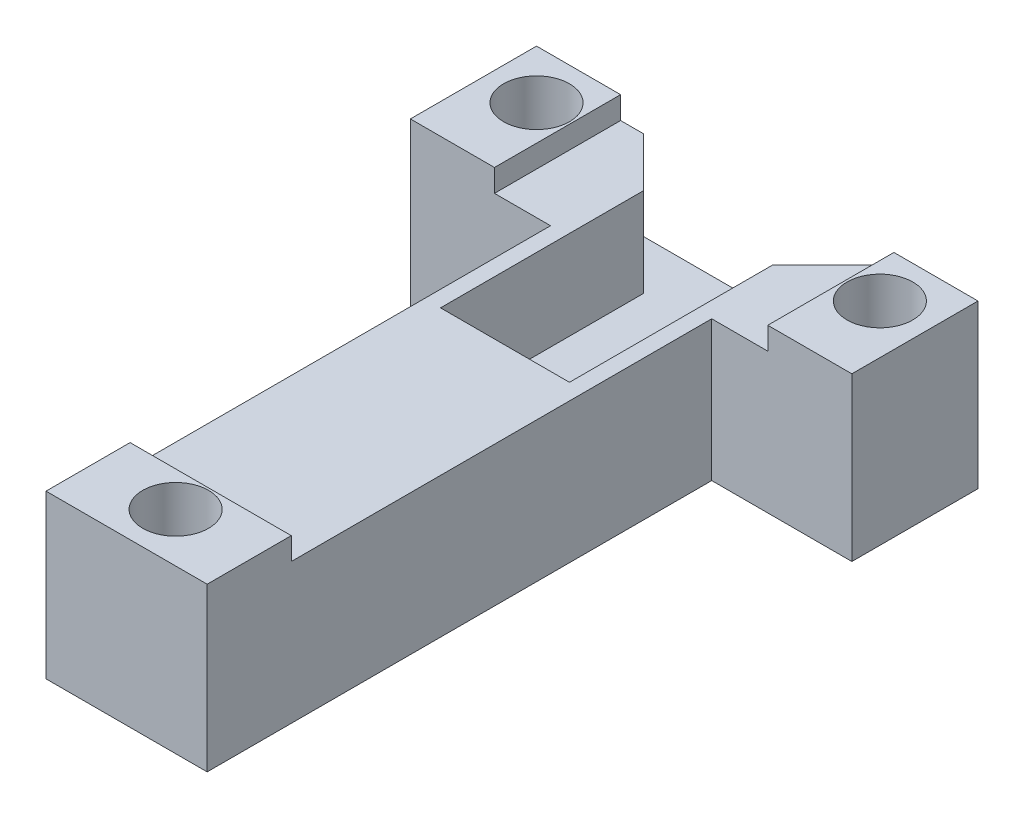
ISO-10303-21;
HEADER;
FILE_DESCRIPTION(('STEP AP214'),'2;1');
FILE_NAME('part.step','',(''),(''),'','','');
FILE_SCHEMA(('AUTOMOTIVE_DESIGN { 1 0 10303 214 1 1 1 1 }'));
ENDSEC;
DATA;
#1=APPLICATION_CONTEXT('core data for automotive mechanical design processes');
#2=APPLICATION_PROTOCOL_DEFINITION('international standard','automotive_design',2000,#1);
#3=PRODUCT_CONTEXT('',#1,'mechanical');
#4=PRODUCT('Part','Part','',(#3));
#5=PRODUCT_RELATED_PRODUCT_CATEGORY('part','',(#4));
#6=PRODUCT_DEFINITION_FORMATION('','',#4);
#7=PRODUCT_DEFINITION_CONTEXT('part definition',#1,'design');
#8=PRODUCT_DEFINITION('design','',#6,#7);
#9=PRODUCT_DEFINITION_SHAPE('','',#8);
#10=(LENGTH_UNIT() NAMED_UNIT(*) SI_UNIT(.MILLI.,.METRE.));
#11=(NAMED_UNIT(*) PLANE_ANGLE_UNIT() SI_UNIT($,.RADIAN.));
#12=(NAMED_UNIT(*) SI_UNIT($,.STERADIAN.) SOLID_ANGLE_UNIT());
#13=UNCERTAINTY_MEASURE_WITH_UNIT(LENGTH_MEASURE(1.E-05),#10,'distance_accuracy_value','');
#14=(GEOMETRIC_REPRESENTATION_CONTEXT(3) GLOBAL_UNCERTAINTY_ASSIGNED_CONTEXT((#13)) GLOBAL_UNIT_ASSIGNED_CONTEXT((#10,
#11,#12)) REPRESENTATION_CONTEXT('',''));
#15=CARTESIAN_POINT('',(0.,0.,0.));
#16=DIRECTION('',(0.,0.,1.));
#17=DIRECTION('',(1.,0.,0.));
#18=AXIS2_PLACEMENT_3D('',#15,#16,#17);
#19=CARTESIAN_POINT('',(0.,10.,-45.));
#20=DIRECTION('',(0.,0.,1.));
#21=DIRECTION('',(1.,0.,0.));
#22=AXIS2_PLACEMENT_3D('',#19,#20,#21);
#23=PLANE('',#22);
#24=DIRECTION('',(0.,1.,0.));
#25=VECTOR('',#24,1.);
#26=CARTESIAN_POINT('',(-2.35,3.65,-45.));
#27=LINE('',#26,#25);
#28=CARTESIAN_POINT('',(-2.35,3.65,-45.));
#29=VERTEX_POINT('',#28);
#30=CARTESIAN_POINT('',(-2.35,10.,-45.));
#31=VERTEX_POINT('',#30);
#32=EDGE_CURVE('E377',#29,#31,#27,.T.);
#33=ORIENTED_EDGE('',*,*,#32,.F.);
#34=DIRECTION('',(-1.,0.,0.));
#35=VECTOR('',#34,1.);
#36=CARTESIAN_POINT('',(0.,3.65,-45.));
#37=LINE('',#36,#35);
#38=CARTESIAN_POINT('',(13.85,3.65,-45.));
#39=VERTEX_POINT('',#38);
#40=EDGE_CURVE('E346',#39,#29,#37,.T.);
#41=ORIENTED_EDGE('',*,*,#40,.F.);
#42=DIRECTION('',(0.,1.,0.));
#43=VECTOR('',#42,1.);
#44=CARTESIAN_POINT('',(13.85,3.65,-45.));
#45=LINE('',#44,#43);
#46=CARTESIAN_POINT('',(13.85,10.,-45.));
#47=VERTEX_POINT('',#46);
#48=EDGE_CURVE('E380',#39,#47,#45,.T.);
#49=ORIENTED_EDGE('',*,*,#48,.T.);
#50=DIRECTION('',(-1.,0.,0.));
#51=VECTOR('',#50,1.);
#52=CARTESIAN_POINT('',(0.,10.,-45.));
#53=LINE('',#52,#51);
#54=CARTESIAN_POINT('',(15.5,10.,-45.));
#55=VERTEX_POINT('',#54);
#56=EDGE_CURVE('E405',#55,#47,#53,.T.);
#57=ORIENTED_EDGE('',*,*,#56,.F.);
#58=DIRECTION('',(0.,-1.,0.));
#59=VECTOR('',#58,1.);
#60=CARTESIAN_POINT('',(15.5,11.6,-45.));
#61=LINE('',#60,#59);
#62=CARTESIAN_POINT('',(15.5,11.6,-45.));
#63=VERTEX_POINT('',#62);
#64=EDGE_CURVE('E267',#63,#55,#61,.T.);
#65=ORIENTED_EDGE('',*,*,#64,.F.);
#66=DIRECTION('',(-1.,0.,0.));
#67=VECTOR('',#66,1.);
#68=CARTESIAN_POINT('',(0.,11.6,-45.));
#69=LINE('',#68,#67);
#70=CARTESIAN_POINT('',(21.5,11.6,-45.));
#71=VERTEX_POINT('',#70);
#72=EDGE_CURVE('E260',#71,#63,#69,.T.);
#73=ORIENTED_EDGE('',*,*,#72,.F.);
#74=DIRECTION('',(0.,-1.,0.));
#75=VECTOR('',#74,1.);
#76=CARTESIAN_POINT('',(21.5,10.,-45.));
#77=LINE('',#76,#75);
#78=CARTESIAN_POINT('',(21.5,0.,-45.));
#79=VERTEX_POINT('',#78);
#80=EDGE_CURVE('E440',#71,#79,#77,.T.);
#81=ORIENTED_EDGE('',*,*,#80,.T.);
#82=DIRECTION('',(-1.,0.,0.));
#83=VECTOR('',#82,1.);
#84=CARTESIAN_POINT('',(0.,0.,-45.));
#85=LINE('',#84,#83);
#86=CARTESIAN_POINT('',(-10.,0.,-45.));
#87=VERTEX_POINT('',#86);
#88=EDGE_CURVE('E404',#79,#87,#85,.T.);
#89=ORIENTED_EDGE('',*,*,#88,.T.);
#90=DIRECTION('',(0.,-1.,0.));
#91=VECTOR('',#90,1.);
#92=CARTESIAN_POINT('',(-10.,10.,-45.));
#93=LINE('',#92,#91);
#94=CARTESIAN_POINT('',(-10.,11.6,-45.));
#95=VERTEX_POINT('',#94);
#96=EDGE_CURVE('E408',#95,#87,#93,.T.);
#97=ORIENTED_EDGE('',*,*,#96,.F.);
#98=DIRECTION('',(-1.,0.,0.));
#99=VECTOR('',#98,1.);
#100=CARTESIAN_POINT('',(0.,11.6,-45.));
#101=LINE('',#100,#99);
#102=CARTESIAN_POINT('',(-4.,11.6,-45.));
#103=VERTEX_POINT('',#102);
#104=EDGE_CURVE('E287',#103,#95,#101,.T.);
#105=ORIENTED_EDGE('',*,*,#104,.F.);
#106=DIRECTION('',(0.,-1.,0.));
#107=VECTOR('',#106,1.);
#108=CARTESIAN_POINT('',(-4.,11.6,-45.));
#109=LINE('',#108,#107);
#110=CARTESIAN_POINT('',(-4.,10.,-45.));
#111=VERTEX_POINT('',#110);
#112=EDGE_CURVE('E295',#103,#111,#109,.T.);
#113=ORIENTED_EDGE('',*,*,#112,.T.);
#114=EDGE_CURVE('E403',#31,#111,#53,.T.);
#115=ORIENTED_EDGE('',*,*,#114,.F.);
#116=EDGE_LOOP('',(#33,#41,#49,#57,#65,#73,#81,#89,#97,#105,#113,#115));
#117=FACE_BOUND('',#116,.T.);
#118=ADVANCED_FACE('F69',(#117),#23,.F.);
#119=CARTESIAN_POINT('',(0.,10.,0.));
#120=DIRECTION('',(0.,1.,0.));
#121=DIRECTION('',(0.,0.,1.));
#122=AXIS2_PLACEMENT_3D('',#119,#120,#121);
#123=PLANE('',#122);
#124=DIRECTION('',(1.,0.,0.));
#125=VECTOR('',#124,1.);
#126=CARTESIAN_POINT('',(0.,10.,-6.));
#127=LINE('',#126,#125);
#128=CARTESIAN_POINT('',(0.,10.,-6.));
#129=VERTEX_POINT('',#128);
#130=CARTESIAN_POINT('',(11.5,10.,-6.));
#131=VERTEX_POINT('',#130);
#132=EDGE_CURVE('E87',#129,#131,#127,.T.);
#133=ORIENTED_EDGE('',*,*,#132,.T.);
#134=DIRECTION('',(0.,0.,-1.));
#135=VECTOR('',#134,1.);
#136=CARTESIAN_POINT('',(11.5,10.,0.));
#137=LINE('',#136,#135);
#138=CARTESIAN_POINT('',(11.5,10.,-36.));
#139=VERTEX_POINT('',#138);
#140=EDGE_CURVE('E446',#131,#139,#137,.T.);
#141=ORIENTED_EDGE('',*,*,#140,.T.);
#142=DIRECTION('',(-1.,0.,0.));
#143=VECTOR('',#142,1.);
#144=CARTESIAN_POINT('',(0.,10.,-36.));
#145=LINE('',#144,#143);
#146=CARTESIAN_POINT('',(15.5,10.,-36.));
#147=VERTEX_POINT('',#146);
#148=EDGE_CURVE('E425',#147,#139,#145,.T.);
#149=ORIENTED_EDGE('',*,*,#148,.F.);
#150=DIRECTION('',(0.,0.,-1.));
#151=VECTOR('',#150,1.);
#152=CARTESIAN_POINT('',(15.5,10.,0.));
#153=LINE('',#152,#151);
#154=EDGE_CURVE('E95',#147,#55,#153,.T.);
#155=ORIENTED_EDGE('',*,*,#154,.T.);
#156=ORIENTED_EDGE('',*,*,#56,.T.);
#157=DIRECTION('',(0.707106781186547,0.,-0.707106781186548));
#158=VECTOR('',#157,1.);
#159=CARTESIAN_POINT('',(-15.575,10.,-15.575));
#160=LINE('',#159,#158);
#161=CARTESIAN_POINT('',(10.35,10.,-41.5));
#162=VERTEX_POINT('',#161);
#163=EDGE_CURVE('E365',#162,#47,#160,.T.);
#164=ORIENTED_EDGE('',*,*,#163,.F.);
#165=DIRECTION('',(0.,0.,-1.));
#166=VECTOR('',#165,1.);
#167=CARTESIAN_POINT('',(10.35,10.,0.));
#168=LINE('',#167,#166);
#169=CARTESIAN_POINT('',(10.35,10.,-27.));
#170=VERTEX_POINT('',#169);
#171=EDGE_CURVE('E361',#170,#162,#168,.T.);
#172=ORIENTED_EDGE('',*,*,#171,.F.);
#173=DIRECTION('',(1.,0.,0.));
#174=VECTOR('',#173,1.);
#175=CARTESIAN_POINT('',(0.,10.,-27.));
#176=LINE('',#175,#174);
#177=CARTESIAN_POINT('',(1.15,10.,-27.));
#178=VERTEX_POINT('',#177);
#179=EDGE_CURVE('E357',#178,#170,#176,.T.);
#180=ORIENTED_EDGE('',*,*,#179,.F.);
#181=DIRECTION('',(0.,0.,-1.));
#182=VECTOR('',#181,1.);
#183=CARTESIAN_POINT('',(1.15,10.,0.));
#184=LINE('',#183,#182);
#185=CARTESIAN_POINT('',(1.15,10.,-41.5));
#186=VERTEX_POINT('',#185);
#187=EDGE_CURVE('E311',#178,#186,#184,.T.);
#188=ORIENTED_EDGE('',*,*,#187,.T.);
#189=DIRECTION('',(-0.707106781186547,0.,-0.707106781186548));
#190=VECTOR('',#189,1.);
#191=CARTESIAN_POINT('',(21.325,10.,-21.325));
#192=LINE('',#191,#190);
#193=EDGE_CURVE('E334',#186,#31,#192,.T.);
#194=ORIENTED_EDGE('',*,*,#193,.T.);
#195=ORIENTED_EDGE('',*,*,#114,.T.);
#196=DIRECTION('',(0.,0.,-1.));
#197=VECTOR('',#196,1.);
#198=CARTESIAN_POINT('',(-4.,10.,0.));
#199=LINE('',#198,#197);
#200=CARTESIAN_POINT('',(-4.,10.,-36.));
#201=VERTEX_POINT('',#200);
#202=EDGE_CURVE('E275',#201,#111,#199,.T.);
#203=ORIENTED_EDGE('',*,*,#202,.F.);
#204=DIRECTION('',(1.,0.,0.));
#205=VECTOR('',#204,1.);
#206=CARTESIAN_POINT('',(0.,10.,-36.));
#207=LINE('',#206,#205);
#208=CARTESIAN_POINT('',(0.,10.,-36.));
#209=VERTEX_POINT('',#208);
#210=EDGE_CURVE('E399',#201,#209,#207,.T.);
#211=ORIENTED_EDGE('',*,*,#210,.T.);
#212=DIRECTION('',(0.,0.,-1.));
#213=VECTOR('',#212,1.);
#214=CARTESIAN_POINT('',(0.,10.,0.));
#215=LINE('',#214,#213);
#216=EDGE_CURVE('E449',#129,#209,#215,.T.);
#217=ORIENTED_EDGE('',*,*,#216,.F.);
#218=EDGE_LOOP('',(#133,#141,#149,#155,#156,#164,#172,#180,#188,#194,#195,#203,#211,#217));
#219=FACE_BOUND('',#218,.T.);
#220=ADVANCED_FACE('F494',(#219),#123,.T.);
#221=CARTESIAN_POINT('',(-9.99999999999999,10.,0.));
#222=DIRECTION('',(1.,0.,0.));
#223=DIRECTION('',(0.,0.,-1.));
#224=AXIS2_PLACEMENT_3D('',#221,#222,#223);
#225=PLANE('',#224);
#226=DIRECTION('',(0.,0.,1.));
#227=VECTOR('',#226,1.);
#228=CARTESIAN_POINT('',(-9.99999999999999,0.,0.));
#229=LINE('',#228,#227);
#230=CARTESIAN_POINT('',(-10.,0.,-36.));
#231=VERTEX_POINT('',#230);
#232=EDGE_CURVE('E409',#87,#231,#229,.T.);
#233=ORIENTED_EDGE('',*,*,#232,.T.);
#234=DIRECTION('',(0.,-1.,0.));
#235=VECTOR('',#234,1.);
#236=CARTESIAN_POINT('',(-10.,10.,-36.));
#237=LINE('',#236,#235);
#238=CARTESIAN_POINT('',(-10.,11.6,-36.));
#239=VERTEX_POINT('',#238);
#240=EDGE_CURVE('E12',#239,#231,#237,.T.);
#241=ORIENTED_EDGE('',*,*,#240,.F.);
#242=DIRECTION('',(0.,0.,1.));
#243=VECTOR('',#242,1.);
#244=CARTESIAN_POINT('',(-9.99999999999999,11.6,0.));
#245=LINE('',#244,#243);
#246=EDGE_CURVE('E291',#95,#239,#245,.T.);
#247=ORIENTED_EDGE('',*,*,#246,.F.);
#248=ORIENTED_EDGE('',*,*,#96,.T.);
#249=EDGE_LOOP('',(#233,#241,#247,#248));
#250=FACE_BOUND('',#249,.T.);
#251=ADVANCED_FACE('F480',(#250),#225,.F.);
#252=CARTESIAN_POINT('',(0.,10.,-36.));
#253=DIRECTION('',(0.,0.,-1.));
#254=DIRECTION('',(-1.,0.,0.));
#255=AXIS2_PLACEMENT_3D('',#252,#253,#254);
#256=PLANE('',#255);
#257=DIRECTION('',(1.,0.,0.));
#258=VECTOR('',#257,1.);
#259=CARTESIAN_POINT('',(0.,0.,-36.));
#260=LINE('',#259,#258);
#261=CARTESIAN_POINT('',(0.,0.,-36.));
#262=VERTEX_POINT('',#261);
#263=EDGE_CURVE('E413',#231,#262,#260,.T.);
#264=ORIENTED_EDGE('',*,*,#263,.T.);
#265=DIRECTION('',(0.,-1.,0.));
#266=VECTOR('',#265,1.);
#267=CARTESIAN_POINT('',(0.,10.,-36.));
#268=LINE('',#267,#266);
#269=EDGE_CURVE('E79',#209,#262,#268,.T.);
#270=ORIENTED_EDGE('',*,*,#269,.F.);
#271=ORIENTED_EDGE('',*,*,#210,.F.);
#272=DIRECTION('',(0.,-1.,0.));
#273=VECTOR('',#272,1.);
#274=CARTESIAN_POINT('',(-4.,11.6,-36.));
#275=LINE('',#274,#273);
#276=CARTESIAN_POINT('',(-4.,11.6,-36.));
#277=VERTEX_POINT('',#276);
#278=EDGE_CURVE('E302',#277,#201,#275,.T.);
#279=ORIENTED_EDGE('',*,*,#278,.F.);
#280=DIRECTION('',(1.,0.,0.));
#281=VECTOR('',#280,1.);
#282=CARTESIAN_POINT('',(0.,11.6,-36.));
#283=LINE('',#282,#281);
#284=EDGE_CURVE('E280',#239,#277,#283,.T.);
#285=ORIENTED_EDGE('',*,*,#284,.F.);
#286=ORIENTED_EDGE('',*,*,#240,.T.);
#287=EDGE_LOOP('',(#264,#270,#271,#279,#285,#286));
#288=FACE_BOUND('',#287,.T.);
#289=ADVANCED_FACE('F476',(#288),#256,.F.);
#290=CARTESIAN_POINT('',(0.,0.,0.));
#291=DIRECTION('',(0.,1.,0.));
#292=DIRECTION('',(0.,0.,1.));
#293=AXIS2_PLACEMENT_3D('',#290,#291,#292);
#294=PLANE('',#293);
#295=CARTESIAN_POINT('',(5.74999999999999,0.,-10.));
#296=DIRECTION('',(0.,-1.,0.));
#297=DIRECTION('',(0.,0.,-1.));
#298=AXIS2_PLACEMENT_3D('',#295,#296,#297);
#299=CIRCLE('',#298,2.3495);
#300=CARTESIAN_POINT('',(5.74999999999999,0.,-12.3495));
#301=VERTEX_POINT('',#300);
#302=EDGE_CURVE('E312',#301,#301,#299,.T.);
#303=ORIENTED_EDGE('',*,*,#302,.F.);
#304=EDGE_LOOP('',(#303));
#305=FACE_BOUND('',#304,.T.);
#306=CARTESIAN_POINT('',(5.75,0.,-22.));
#307=DIRECTION('',(0.,-1.,0.));
#308=DIRECTION('',(0.,0.,-1.));
#309=AXIS2_PLACEMENT_3D('',#306,#307,#308);
#310=CIRCLE('',#309,2.3495);
#311=CARTESIAN_POINT('',(5.75,0.,-24.3495));
#312=VERTEX_POINT('',#311);
#313=EDGE_CURVE('E316',#312,#312,#310,.T.);
#314=ORIENTED_EDGE('',*,*,#313,.F.);
#315=EDGE_LOOP('',(#314));
#316=FACE_BOUND('',#315,.T.);
#317=ORIENTED_EDGE('',*,*,#232,.F.);
#318=ORIENTED_EDGE('',*,*,#88,.F.);
#319=DIRECTION('',(0.,0.,1.));
#320=VECTOR('',#319,1.);
#321=CARTESIAN_POINT('',(21.5,0.,0.));
#322=LINE('',#321,#320);
#323=CARTESIAN_POINT('',(21.5,0.,-36.));
#324=VERTEX_POINT('',#323);
#325=EDGE_CURVE('E430',#79,#324,#322,.T.);
#326=ORIENTED_EDGE('',*,*,#325,.T.);
#327=DIRECTION('',(-1.,0.,0.));
#328=VECTOR('',#327,1.);
#329=CARTESIAN_POINT('',(0.,0.,-36.));
#330=LINE('',#329,#328);
#331=CARTESIAN_POINT('',(11.5,0.,-36.));
#332=VERTEX_POINT('',#331);
#333=EDGE_CURVE('E431',#324,#332,#330,.T.);
#334=ORIENTED_EDGE('',*,*,#333,.T.);
#335=DIRECTION('',(0.,0.,-1.));
#336=VECTOR('',#335,1.);
#337=CARTESIAN_POINT('',(11.5,0.,0.));
#338=LINE('',#337,#336);
#339=CARTESIAN_POINT('',(11.5,0.,0.));
#340=VERTEX_POINT('',#339);
#341=EDGE_CURVE('E456',#340,#332,#338,.T.);
#342=ORIENTED_EDGE('',*,*,#341,.F.);
#343=DIRECTION('',(1.,0.,0.));
#344=VECTOR('',#343,1.);
#345=CARTESIAN_POINT('',(0.,0.,0.));
#346=LINE('',#345,#344);
#347=CARTESIAN_POINT('',(0.,0.,0.));
#348=VERTEX_POINT('',#347);
#349=EDGE_CURVE('E327',#348,#340,#346,.T.);
#350=ORIENTED_EDGE('',*,*,#349,.F.);
#351=DIRECTION('',(0.,0.,-1.));
#352=VECTOR('',#351,1.);
#353=CARTESIAN_POINT('',(0.,0.,0.));
#354=LINE('',#353,#352);
#355=EDGE_CURVE('E450',#348,#262,#354,.T.);
#356=ORIENTED_EDGE('',*,*,#355,.T.);
#357=ORIENTED_EDGE('',*,*,#263,.F.);
#358=EDGE_LOOP('',(#317,#318,#326,#334,#342,#350,#356,#357));
#359=FACE_BOUND('',#358,.T.);
#360=ADVANCED_FACE('F472',(#305,#316,#359),#294,.F.);
#361=CARTESIAN_POINT('',(21.5,10.,0.));
#362=DIRECTION('',(1.,0.,0.));
#363=DIRECTION('',(0.,0.,-1.));
#364=AXIS2_PLACEMENT_3D('',#361,#362,#363);
#365=PLANE('',#364);
#366=ORIENTED_EDGE('',*,*,#325,.F.);
#367=ORIENTED_EDGE('',*,*,#80,.F.);
#368=DIRECTION('',(0.,0.,-1.));
#369=VECTOR('',#368,1.);
#370=CARTESIAN_POINT('',(21.5,11.6,0.));
#371=LINE('',#370,#369);
#372=CARTESIAN_POINT('',(21.5,11.6,-36.));
#373=VERTEX_POINT('',#372);
#374=EDGE_CURVE('E256',#373,#71,#371,.T.);
#375=ORIENTED_EDGE('',*,*,#374,.F.);
#376=DIRECTION('',(0.,-1.,0.));
#377=VECTOR('',#376,1.);
#378=CARTESIAN_POINT('',(21.5,10.,-36.));
#379=LINE('',#378,#377);
#380=EDGE_CURVE('E414',#373,#324,#379,.T.);
#381=ORIENTED_EDGE('',*,*,#380,.T.);
#382=EDGE_LOOP('',(#366,#367,#375,#381));
#383=FACE_BOUND('',#382,.T.);
#384=ADVANCED_FACE('F532',(#383),#365,.T.);
#385=CARTESIAN_POINT('',(0.,10.,-36.));
#386=DIRECTION('',(0.,0.,1.));
#387=DIRECTION('',(1.,0.,0.));
#388=AXIS2_PLACEMENT_3D('',#385,#386,#387);
#389=PLANE('',#388);
#390=ORIENTED_EDGE('',*,*,#333,.F.);
#391=ORIENTED_EDGE('',*,*,#380,.F.);
#392=DIRECTION('',(1.,0.,0.));
#393=VECTOR('',#392,1.);
#394=CARTESIAN_POINT('',(0.,11.6,-36.));
#395=LINE('',#394,#393);
#396=CARTESIAN_POINT('',(15.5,11.6,-36.));
#397=VERTEX_POINT('',#396);
#398=EDGE_CURVE('E252',#397,#373,#395,.T.);
#399=ORIENTED_EDGE('',*,*,#398,.F.);
#400=DIRECTION('',(0.,-1.,0.));
#401=VECTOR('',#400,1.);
#402=CARTESIAN_POINT('',(15.5,11.6,-36.));
#403=LINE('',#402,#401);
#404=EDGE_CURVE('E272',#397,#147,#403,.T.);
#405=ORIENTED_EDGE('',*,*,#404,.T.);
#406=ORIENTED_EDGE('',*,*,#148,.T.);
#407=DIRECTION('',(0.,-1.,0.));
#408=VECTOR('',#407,1.);
#409=CARTESIAN_POINT('',(11.5,10.,-36.));
#410=LINE('',#409,#408);
#411=EDGE_CURVE('E429',#139,#332,#410,.T.);
#412=ORIENTED_EDGE('',*,*,#411,.T.);
#413=EDGE_LOOP('',(#390,#391,#399,#405,#406,#412));
#414=FACE_BOUND('',#413,.T.);
#415=ADVANCED_FACE('F521',(#414),#389,.T.);
#416=CARTESIAN_POINT('',(11.5,10.,0.));
#417=DIRECTION('',(-1.,0.,0.));
#418=DIRECTION('',(0.,0.,1.));
#419=AXIS2_PLACEMENT_3D('',#416,#417,#418);
#420=PLANE('',#419);
#421=ORIENTED_EDGE('',*,*,#411,.F.);
#422=ORIENTED_EDGE('',*,*,#140,.F.);
#423=DIRECTION('',(0.,-1.,0.));
#424=VECTOR('',#423,1.);
#425=CARTESIAN_POINT('',(11.5,11.6,-6.));
#426=LINE('',#425,#424);
#427=CARTESIAN_POINT('',(11.5,11.6,-6.));
#428=VERTEX_POINT('',#427);
#429=EDGE_CURVE('E215',#428,#131,#426,.T.);
#430=ORIENTED_EDGE('',*,*,#429,.F.);
#431=DIRECTION('',(0.,0.,-1.));
#432=VECTOR('',#431,1.);
#433=CARTESIAN_POINT('',(11.5,11.6,0.));
#434=LINE('',#433,#432);
#435=CARTESIAN_POINT('',(11.5,11.6,0.));
#436=VERTEX_POINT('',#435);
#437=EDGE_CURVE('E231',#436,#428,#434,.T.);
#438=ORIENTED_EDGE('',*,*,#437,.F.);
#439=DIRECTION('',(0.,-1.,0.));
#440=VECTOR('',#439,1.);
#441=CARTESIAN_POINT('',(11.5,10.,0.));
#442=LINE('',#441,#440);
#443=EDGE_CURVE('E73',#436,#340,#442,.T.);
#444=ORIENTED_EDGE('',*,*,#443,.T.);
#445=ORIENTED_EDGE('',*,*,#341,.T.);
#446=EDGE_LOOP('',(#421,#422,#430,#438,#444,#445));
#447=FACE_BOUND('',#446,.T.);
#448=ADVANCED_FACE('F469',(#447),#420,.F.);
#449=CARTESIAN_POINT('',(0.,10.,0.));
#450=DIRECTION('',(0.,0.,-1.));
#451=DIRECTION('',(-1.,0.,0.));
#452=AXIS2_PLACEMENT_3D('',#449,#450,#451);
#453=PLANE('',#452);
#454=ORIENTED_EDGE('',*,*,#349,.T.);
#455=ORIENTED_EDGE('',*,*,#443,.F.);
#456=DIRECTION('',(1.,0.,0.));
#457=VECTOR('',#456,1.);
#458=CARTESIAN_POINT('',(0.,11.6,0.));
#459=LINE('',#458,#457);
#460=CARTESIAN_POINT('',(0.,11.6,0.));
#461=VERTEX_POINT('',#460);
#462=EDGE_CURVE('E226',#461,#436,#459,.T.);
#463=ORIENTED_EDGE('',*,*,#462,.F.);
#464=DIRECTION('',(0.,-1.,0.));
#465=VECTOR('',#464,1.);
#466=CARTESIAN_POINT('',(0.,10.,0.));
#467=LINE('',#466,#465);
#468=EDGE_CURVE('E221',#461,#348,#467,.T.);
#469=ORIENTED_EDGE('',*,*,#468,.T.);
#470=EDGE_LOOP('',(#454,#455,#463,#469));
#471=FACE_BOUND('',#470,.T.);
#472=ADVANCED_FACE('F71',(#471),#453,.F.);
#473=CARTESIAN_POINT('',(0.,10.,0.));
#474=DIRECTION('',(-1.,0.,0.));
#475=DIRECTION('',(0.,0.,1.));
#476=AXIS2_PLACEMENT_3D('',#473,#474,#475);
#477=PLANE('',#476);
#478=ORIENTED_EDGE('',*,*,#468,.F.);
#479=DIRECTION('',(0.,0.,1.));
#480=VECTOR('',#479,1.);
#481=CARTESIAN_POINT('',(0.,11.6,0.));
#482=LINE('',#481,#480);
#483=CARTESIAN_POINT('',(0.,11.6,-6.));
#484=VERTEX_POINT('',#483);
#485=EDGE_CURVE('E218',#484,#461,#482,.T.);
#486=ORIENTED_EDGE('',*,*,#485,.F.);
#487=DIRECTION('',(0.,-1.,0.));
#488=VECTOR('',#487,1.);
#489=CARTESIAN_POINT('',(0.,11.6,-6.));
#490=LINE('',#489,#488);
#491=EDGE_CURVE('E207',#484,#129,#490,.T.);
#492=ORIENTED_EDGE('',*,*,#491,.T.);
#493=ORIENTED_EDGE('',*,*,#216,.T.);
#494=ORIENTED_EDGE('',*,*,#269,.T.);
#495=ORIENTED_EDGE('',*,*,#355,.F.);
#496=EDGE_LOOP('',(#478,#486,#492,#493,#494,#495));
#497=FACE_BOUND('',#496,.T.);
#498=ADVANCED_FACE('F219',(#497),#477,.T.);
#499=CARTESIAN_POINT('',(1.15,3.65,0.));
#500=DIRECTION('',(1.,0.,0.));
#501=DIRECTION('',(0.,0.,-1.));
#502=AXIS2_PLACEMENT_3D('',#499,#500,#501);
#503=PLANE('',#502);
#504=ORIENTED_EDGE('',*,*,#187,.F.);
#505=DIRECTION('',(0.,1.,0.));
#506=VECTOR('',#505,1.);
#507=CARTESIAN_POINT('',(1.15,3.65,-27.));
#508=LINE('',#507,#506);
#509=CARTESIAN_POINT('',(1.15,3.65,-27.));
#510=VERTEX_POINT('',#509);
#511=EDGE_CURVE('E353',#510,#178,#508,.T.);
#512=ORIENTED_EDGE('',*,*,#511,.F.);
#513=DIRECTION('',(0.,0.,-1.));
#514=VECTOR('',#513,1.);
#515=CARTESIAN_POINT('',(1.15,3.65,0.));
#516=LINE('',#515,#514);
#517=CARTESIAN_POINT('',(1.15,3.65,-41.5));
#518=VERTEX_POINT('',#517);
#519=EDGE_CURVE('E329',#510,#518,#516,.T.);
#520=ORIENTED_EDGE('',*,*,#519,.T.);
#521=DIRECTION('',(0.,1.,0.));
#522=VECTOR('',#521,1.);
#523=CARTESIAN_POINT('',(1.15,3.65,-41.5));
#524=LINE('',#523,#522);
#525=EDGE_CURVE('E372',#518,#186,#524,.T.);
#526=ORIENTED_EDGE('',*,*,#525,.T.);
#527=EDGE_LOOP('',(#504,#512,#520,#526));
#528=FACE_BOUND('',#527,.T.);
#529=ADVANCED_FACE('F500',(#528),#503,.T.);
#530=CARTESIAN_POINT('',(21.325,3.65,-21.325));
#531=DIRECTION('',(0.707106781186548,0.,-0.707106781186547));
#532=DIRECTION('',(-0.707106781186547,0.,-0.707106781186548));
#533=AXIS2_PLACEMENT_3D('',#530,#531,#532);
#534=PLANE('',#533);
#535=ORIENTED_EDGE('',*,*,#193,.F.);
#536=ORIENTED_EDGE('',*,*,#525,.F.);
#537=DIRECTION('',(-0.707106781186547,0.,-0.707106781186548));
#538=VECTOR('',#537,1.);
#539=CARTESIAN_POINT('',(21.325,3.65,-21.325));
#540=LINE('',#539,#538);
#541=EDGE_CURVE('E350',#518,#29,#540,.T.);
#542=ORIENTED_EDGE('',*,*,#541,.T.);
#543=ORIENTED_EDGE('',*,*,#32,.T.);
#544=EDGE_LOOP('',(#535,#536,#542,#543));
#545=FACE_BOUND('',#544,.T.);
#546=ADVANCED_FACE('F498',(#545),#534,.T.);
#547=CARTESIAN_POINT('',(-15.575,3.65,-15.575));
#548=DIRECTION('',(0.707106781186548,0.,0.707106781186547));
#549=DIRECTION('',(0.707106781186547,0.,-0.707106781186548));
#550=AXIS2_PLACEMENT_3D('',#547,#548,#549);
#551=PLANE('',#550);
#552=ORIENTED_EDGE('',*,*,#163,.T.);
#553=ORIENTED_EDGE('',*,*,#48,.F.);
#554=DIRECTION('',(0.707106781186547,0.,-0.707106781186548));
#555=VECTOR('',#554,1.);
#556=CARTESIAN_POINT('',(-15.575,3.65,-15.575));
#557=LINE('',#556,#555);
#558=CARTESIAN_POINT('',(10.35,3.65,-41.5));
#559=VERTEX_POINT('',#558);
#560=EDGE_CURVE('E342',#559,#39,#557,.T.);
#561=ORIENTED_EDGE('',*,*,#560,.F.);
#562=DIRECTION('',(0.,1.,0.));
#563=VECTOR('',#562,1.);
#564=CARTESIAN_POINT('',(10.35,3.65,-41.5));
#565=LINE('',#564,#563);
#566=EDGE_CURVE('E384',#559,#162,#565,.T.);
#567=ORIENTED_EDGE('',*,*,#566,.T.);
#568=EDGE_LOOP('',(#552,#553,#561,#567));
#569=FACE_BOUND('',#568,.T.);
#570=ADVANCED_FACE('F515',(#569),#551,.F.);
#571=CARTESIAN_POINT('',(10.35,3.65,0.));
#572=DIRECTION('',(1.,0.,0.));
#573=DIRECTION('',(0.,0.,-1.));
#574=AXIS2_PLACEMENT_3D('',#571,#572,#573);
#575=PLANE('',#574);
#576=ORIENTED_EDGE('',*,*,#171,.T.);
#577=ORIENTED_EDGE('',*,*,#566,.F.);
#578=DIRECTION('',(0.,0.,-1.));
#579=VECTOR('',#578,1.);
#580=CARTESIAN_POINT('',(10.35,3.65,0.));
#581=LINE('',#580,#579);
#582=CARTESIAN_POINT('',(10.35,3.65,-27.));
#583=VERTEX_POINT('',#582);
#584=EDGE_CURVE('E338',#583,#559,#581,.T.);
#585=ORIENTED_EDGE('',*,*,#584,.F.);
#586=DIRECTION('',(0.,1.,0.));
#587=VECTOR('',#586,1.);
#588=CARTESIAN_POINT('',(10.35,3.65,-27.));
#589=LINE('',#588,#587);
#590=EDGE_CURVE('E387',#583,#170,#589,.T.);
#591=ORIENTED_EDGE('',*,*,#590,.T.);
#592=EDGE_LOOP('',(#576,#577,#585,#591));
#593=FACE_BOUND('',#592,.T.);
#594=ADVANCED_FACE('F510',(#593),#575,.F.);
#595=CARTESIAN_POINT('',(0.,3.65,-27.));
#596=DIRECTION('',(0.,0.,1.));
#597=DIRECTION('',(1.,0.,0.));
#598=AXIS2_PLACEMENT_3D('',#595,#596,#597);
#599=PLANE('',#598);
#600=ORIENTED_EDGE('',*,*,#179,.T.);
#601=ORIENTED_EDGE('',*,*,#590,.F.);
#602=DIRECTION('',(1.,0.,0.));
#603=VECTOR('',#602,1.);
#604=CARTESIAN_POINT('',(0.,3.65,-27.));
#605=LINE('',#604,#603);
#606=EDGE_CURVE('E333',#510,#583,#605,.T.);
#607=ORIENTED_EDGE('',*,*,#606,.F.);
#608=ORIENTED_EDGE('',*,*,#511,.T.);
#609=EDGE_LOOP('',(#600,#601,#607,#608));
#610=FACE_BOUND('',#609,.T.);
#611=ADVANCED_FACE('F506',(#610),#599,.F.);
#612=CARTESIAN_POINT('',(0.,3.65,0.));
#613=DIRECTION('',(0.,1.,0.));
#614=DIRECTION('',(0.,0.,1.));
#615=AXIS2_PLACEMENT_3D('',#612,#613,#614);
#616=PLANE('',#615);
#617=ORIENTED_EDGE('',*,*,#519,.F.);
#618=ORIENTED_EDGE('',*,*,#606,.T.);
#619=ORIENTED_EDGE('',*,*,#584,.T.);
#620=ORIENTED_EDGE('',*,*,#560,.T.);
#621=ORIENTED_EDGE('',*,*,#40,.T.);
#622=ORIENTED_EDGE('',*,*,#541,.F.);
#623=EDGE_LOOP('',(#617,#618,#619,#620,#621,#622));
#624=FACE_BOUND('',#623,.T.);
#625=ADVANCED_FACE('F504',(#624),#616,.T.);
#626=CARTESIAN_POINT('',(5.75,6.35,-22.));
#627=DIRECTION('',(0.,-1.,0.));
#628=DIRECTION('',(0.,0.,-1.));
#629=AXIS2_PLACEMENT_3D('',#626,#627,#628);
#630=CYLINDRICAL_SURFACE('',#629,2.3495);
#631=CARTESIAN_POINT('',(5.75,6.35,-22.));
#632=DIRECTION('',(0.,-1.,0.));
#633=DIRECTION('',(0.,0.,-1.));
#634=AXIS2_PLACEMENT_3D('',#631,#632,#633);
#635=CIRCLE('',#634,2.3495);
#636=CARTESIAN_POINT('',(5.75,6.35,-24.3495));
#637=VERTEX_POINT('',#636);
#638=EDGE_CURVE('E306',#637,#637,#635,.T.);
#639=ORIENTED_EDGE('',*,*,#638,.F.);
#640=EDGE_LOOP('',(#639));
#641=FACE_BOUND('',#640,.T.);
#642=ORIENTED_EDGE('',*,*,#313,.T.);
#643=EDGE_LOOP('',(#642));
#644=FACE_BOUND('',#643,.T.);
#645=ADVANCED_FACE('F701',(#641,#644),#630,.F.);
#646=CARTESIAN_POINT('',(5.75,6.35,-22.));
#647=DIRECTION('',(0.,-1.,0.));
#648=DIRECTION('',(0.,0.,-1.));
#649=AXIS2_PLACEMENT_3D('',#646,#647,#648);
#650=PLANE('',#649);
#651=ORIENTED_EDGE('',*,*,#638,.T.);
#652=EDGE_LOOP('',(#651));
#653=FACE_BOUND('',#652,.T.);
#654=ADVANCED_FACE('F705',(#653),#650,.T.);
#655=CARTESIAN_POINT('',(5.74999999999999,6.35,-10.));
#656=DIRECTION('',(0.,-1.,0.));
#657=DIRECTION('',(0.,0.,-1.));
#658=AXIS2_PLACEMENT_3D('',#655,#656,#657);
#659=CYLINDRICAL_SURFACE('',#658,2.3495);
#660=CARTESIAN_POINT('',(5.74999999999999,6.35,-10.));
#661=DIRECTION('',(0.,-1.,0.));
#662=DIRECTION('',(0.,0.,-1.));
#663=AXIS2_PLACEMENT_3D('',#660,#661,#662);
#664=CIRCLE('',#663,2.3495);
#665=CARTESIAN_POINT('',(5.74999999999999,6.35,-12.3495));
#666=VERTEX_POINT('',#665);
#667=EDGE_CURVE('E307',#666,#666,#664,.T.);
#668=ORIENTED_EDGE('',*,*,#667,.F.);
#669=EDGE_LOOP('',(#668));
#670=FACE_BOUND('',#669,.T.);
#671=ORIENTED_EDGE('',*,*,#302,.T.);
#672=EDGE_LOOP('',(#671));
#673=FACE_BOUND('',#672,.T.);
#674=ADVANCED_FACE('F716',(#670,#673),#659,.F.);
#675=CARTESIAN_POINT('',(5.74999999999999,6.35,-10.));
#676=DIRECTION('',(0.,-1.,0.));
#677=DIRECTION('',(0.,0.,-1.));
#678=AXIS2_PLACEMENT_3D('',#675,#676,#677);
#679=PLANE('',#678);
#680=ORIENTED_EDGE('',*,*,#667,.T.);
#681=EDGE_LOOP('',(#680));
#682=FACE_BOUND('',#681,.T.);
#683=ADVANCED_FACE('F585',(#682),#679,.T.);
#684=CARTESIAN_POINT('',(-4.,11.6,0.));
#685=DIRECTION('',(-1.,0.,0.));
#686=DIRECTION('',(0.,0.,1.));
#687=AXIS2_PLACEMENT_3D('',#684,#685,#686);
#688=PLANE('',#687);
#689=ORIENTED_EDGE('',*,*,#202,.T.);
#690=ORIENTED_EDGE('',*,*,#112,.F.);
#691=DIRECTION('',(0.,0.,-1.));
#692=VECTOR('',#691,1.);
#693=CARTESIAN_POINT('',(-4.,11.6,0.));
#694=LINE('',#693,#692);
#695=EDGE_CURVE('E284',#277,#103,#694,.T.);
#696=ORIENTED_EDGE('',*,*,#695,.F.);
#697=ORIENTED_EDGE('',*,*,#278,.T.);
#698=EDGE_LOOP('',(#689,#690,#696,#697));
#699=FACE_BOUND('',#698,.T.);
#700=ADVANCED_FACE('F489',(#699),#688,.F.);
#701=CARTESIAN_POINT('',(0.,11.6,0.));
#702=DIRECTION('',(0.,1.,0.));
#703=DIRECTION('',(0.,0.,1.));
#704=AXIS2_PLACEMENT_3D('',#701,#702,#703);
#705=PLANE('',#704);
#706=CARTESIAN_POINT('',(-6.5,11.6,-41.5));
#707=DIRECTION('',(0.,1.,0.));
#708=DIRECTION('',(0.,0.,1.));
#709=AXIS2_PLACEMENT_3D('',#706,#707,#708);
#710=CIRCLE('',#709,2.3495);
#711=CARTESIAN_POINT('',(-6.5,11.6,-39.1505));
#712=VERTEX_POINT('',#711);
#713=EDGE_CURVE('E276',#712,#712,#710,.F.);
#714=ORIENTED_EDGE('',*,*,#713,.T.);
#715=EDGE_LOOP('',(#714));
#716=FACE_BOUND('',#715,.T.);
#717=ORIENTED_EDGE('',*,*,#284,.T.);
#718=ORIENTED_EDGE('',*,*,#695,.T.);
#719=ORIENTED_EDGE('',*,*,#104,.T.);
#720=ORIENTED_EDGE('',*,*,#246,.T.);
#721=EDGE_LOOP('',(#717,#718,#719,#720));
#722=FACE_BOUND('',#721,.T.);
#723=ADVANCED_FACE('F486',(#716,#722),#705,.T.);
#724=CARTESIAN_POINT('',(0.,3.65,0.));
#725=DIRECTION('',(0.,1.,0.));
#726=DIRECTION('',(0.,0.,1.));
#727=AXIS2_PLACEMENT_3D('',#724,#725,#726);
#728=PLANE('',#727);
#729=CARTESIAN_POINT('',(-6.5,3.65,-41.5));
#730=DIRECTION('',(0.,1.,0.));
#731=DIRECTION('',(0.,0.,1.));
#732=AXIS2_PLACEMENT_3D('',#729,#730,#731);
#733=CIRCLE('',#732,2.3495);
#734=CARTESIAN_POINT('',(-6.5,3.65,-39.1505));
#735=VERTEX_POINT('',#734);
#736=EDGE_CURVE('E376',#735,#735,#733,.T.);
#737=ORIENTED_EDGE('',*,*,#736,.T.);
#738=EDGE_LOOP('',(#737));
#739=FACE_BOUND('',#738,.T.);
#740=ADVANCED_FACE('F596',(#739),#728,.T.);
#741=CARTESIAN_POINT('',(-6.5,3.65,-41.5));
#742=DIRECTION('',(0.,1.,0.));
#743=DIRECTION('',(0.,0.,1.));
#744=AXIS2_PLACEMENT_3D('',#741,#742,#743);
#745=CYLINDRICAL_SURFACE('',#744,2.3495);
#746=ORIENTED_EDGE('',*,*,#736,.F.);
#747=EDGE_LOOP('',(#746));
#748=FACE_BOUND('',#747,.T.);
#749=ORIENTED_EDGE('',*,*,#713,.F.);
#750=EDGE_LOOP('',(#749));
#751=FACE_BOUND('',#750,.T.);
#752=ADVANCED_FACE('F605',(#748,#751),#745,.F.);
#753=CARTESIAN_POINT('',(15.5,11.6,0.));
#754=DIRECTION('',(-1.,0.,0.));
#755=DIRECTION('',(0.,0.,1.));
#756=AXIS2_PLACEMENT_3D('',#753,#754,#755);
#757=PLANE('',#756);
#758=ORIENTED_EDGE('',*,*,#154,.F.);
#759=ORIENTED_EDGE('',*,*,#404,.F.);
#760=DIRECTION('',(0.,0.,-1.));
#761=VECTOR('',#760,1.);
#762=CARTESIAN_POINT('',(15.5,11.6,0.));
#763=LINE('',#762,#761);
#764=EDGE_CURVE('E248',#397,#63,#763,.T.);
#765=ORIENTED_EDGE('',*,*,#764,.T.);
#766=ORIENTED_EDGE('',*,*,#64,.T.);
#767=EDGE_LOOP('',(#758,#759,#765,#766));
#768=FACE_BOUND('',#767,.T.);
#769=ADVANCED_FACE('F524',(#768),#757,.T.);
#770=CARTESIAN_POINT('',(0.,11.6,0.));
#771=DIRECTION('',(0.,1.,0.));
#772=DIRECTION('',(0.,0.,1.));
#773=AXIS2_PLACEMENT_3D('',#770,#771,#772);
#774=PLANE('',#773);
#775=ORIENTED_EDGE('',*,*,#764,.F.);
#776=ORIENTED_EDGE('',*,*,#398,.T.);
#777=ORIENTED_EDGE('',*,*,#374,.T.);
#778=ORIENTED_EDGE('',*,*,#72,.T.);
#779=EDGE_LOOP('',(#775,#776,#777,#778));
#780=FACE_BOUND('',#779,.T.);
#781=CARTESIAN_POINT('',(18.,11.6,-41.5));
#782=DIRECTION('',(0.,1.,0.));
#783=DIRECTION('',(0.,0.,1.));
#784=AXIS2_PLACEMENT_3D('',#781,#782,#783);
#785=CIRCLE('',#784,2.3495);
#786=CARTESIAN_POINT('',(18.,11.6,-39.1505));
#787=VERTEX_POINT('',#786);
#788=EDGE_CURVE('E263',#787,#787,#785,.F.);
#789=ORIENTED_EDGE('',*,*,#788,.T.);
#790=EDGE_LOOP('',(#789));
#791=FACE_BOUND('',#790,.T.);
#792=ADVANCED_FACE('F526',(#780,#791),#774,.T.);
#793=CARTESIAN_POINT('',(0.,3.65,0.));
#794=DIRECTION('',(0.,1.,0.));
#795=DIRECTION('',(0.,0.,1.));
#796=AXIS2_PLACEMENT_3D('',#793,#794,#795);
#797=PLANE('',#796);
#798=CARTESIAN_POINT('',(18.,3.65,-41.5));
#799=DIRECTION('',(0.,1.,0.));
#800=DIRECTION('',(0.,0.,1.));
#801=AXIS2_PLACEMENT_3D('',#798,#799,#800);
#802=CIRCLE('',#801,2.3495);
#803=CARTESIAN_POINT('',(18.,3.65,-39.1505));
#804=VERTEX_POINT('',#803);
#805=EDGE_CURVE('E328',#804,#804,#802,.T.);
#806=ORIENTED_EDGE('',*,*,#805,.T.);
#807=EDGE_LOOP('',(#806));
#808=FACE_BOUND('',#807,.T.);
#809=ADVANCED_FACE('F628',(#808),#797,.T.);
#810=CARTESIAN_POINT('',(18.,3.65,-41.5));
#811=DIRECTION('',(0.,1.,0.));
#812=DIRECTION('',(0.,0.,1.));
#813=AXIS2_PLACEMENT_3D('',#810,#811,#812);
#814=CYLINDRICAL_SURFACE('',#813,2.3495);
#815=ORIENTED_EDGE('',*,*,#805,.F.);
#816=EDGE_LOOP('',(#815));
#817=FACE_BOUND('',#816,.T.);
#818=ORIENTED_EDGE('',*,*,#788,.F.);
#819=EDGE_LOOP('',(#818));
#820=FACE_BOUND('',#819,.T.);
#821=ADVANCED_FACE('F636',(#817,#820),#814,.F.);
#822=CARTESIAN_POINT('',(0.,11.6,-6.));
#823=DIRECTION('',(0.,0.,-1.));
#824=DIRECTION('',(-1.,0.,0.));
#825=AXIS2_PLACEMENT_3D('',#822,#823,#824);
#826=PLANE('',#825);
#827=ORIENTED_EDGE('',*,*,#132,.F.);
#828=ORIENTED_EDGE('',*,*,#491,.F.);
#829=DIRECTION('',(1.,0.,0.));
#830=VECTOR('',#829,1.);
#831=CARTESIAN_POINT('',(0.,11.6,-6.));
#832=LINE('',#831,#830);
#833=EDGE_CURVE('E211',#484,#428,#832,.T.);
#834=ORIENTED_EDGE('',*,*,#833,.T.);
#835=ORIENTED_EDGE('',*,*,#429,.T.);
#836=EDGE_LOOP('',(#827,#828,#834,#835));
#837=FACE_BOUND('',#836,.T.);
#838=ADVANCED_FACE('F209',(#837),#826,.T.);
#839=CARTESIAN_POINT('',(0.,11.6,0.));
#840=DIRECTION('',(0.,1.,0.));
#841=DIRECTION('',(0.,0.,1.));
#842=AXIS2_PLACEMENT_3D('',#839,#840,#841);
#843=PLANE('',#842);
#844=ORIENTED_EDGE('',*,*,#833,.F.);
#845=ORIENTED_EDGE('',*,*,#485,.T.);
#846=ORIENTED_EDGE('',*,*,#462,.T.);
#847=ORIENTED_EDGE('',*,*,#437,.T.);
#848=EDGE_LOOP('',(#844,#845,#846,#847));
#849=FACE_BOUND('',#848,.T.);
#850=CARTESIAN_POINT('',(5.75000000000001,11.6,-3.5));
#851=DIRECTION('',(0.,1.,0.));
#852=DIRECTION('',(0.,0.,1.));
#853=AXIS2_PLACEMENT_3D('',#850,#851,#852);
#854=CIRCLE('',#853,2.3495);
#855=CARTESIAN_POINT('',(5.75000000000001,11.6,-1.1505));
#856=VERTEX_POINT('',#855);
#857=EDGE_CURVE('E242',#856,#856,#854,.F.);
#858=ORIENTED_EDGE('',*,*,#857,.T.);
#859=EDGE_LOOP('',(#858));
#860=FACE_BOUND('',#859,.T.);
#861=ADVANCED_FACE('F228',(#849,#860),#843,.T.);
#862=CARTESIAN_POINT('',(0.,3.65,0.));
#863=DIRECTION('',(0.,1.,0.));
#864=DIRECTION('',(0.,0.,1.));
#865=AXIS2_PLACEMENT_3D('',#862,#863,#864);
#866=PLANE('',#865);
#867=CARTESIAN_POINT('',(5.75000000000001,3.65,-3.5));
#868=DIRECTION('',(0.,1.,0.));
#869=DIRECTION('',(0.,0.,1.));
#870=AXIS2_PLACEMENT_3D('',#867,#868,#869);
#871=CIRCLE('',#870,2.3495);
#872=CARTESIAN_POINT('',(5.75000000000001,3.65,-1.1505));
#873=VERTEX_POINT('',#872);
#874=EDGE_CURVE('E323',#873,#873,#871,.T.);
#875=ORIENTED_EDGE('',*,*,#874,.T.);
#876=EDGE_LOOP('',(#875));
#877=FACE_BOUND('',#876,.T.);
#878=ADVANCED_FACE('F659',(#877),#866,.T.);
#879=CARTESIAN_POINT('',(5.75000000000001,3.65,-3.5));
#880=DIRECTION('',(0.,1.,0.));
#881=DIRECTION('',(0.,0.,1.));
#882=AXIS2_PLACEMENT_3D('',#879,#880,#881);
#883=CYLINDRICAL_SURFACE('',#882,2.3495);
#884=ORIENTED_EDGE('',*,*,#874,.F.);
#885=EDGE_LOOP('',(#884));
#886=FACE_BOUND('',#885,.T.);
#887=ORIENTED_EDGE('',*,*,#857,.F.);
#888=EDGE_LOOP('',(#887));
#889=FACE_BOUND('',#888,.T.);
#890=ADVANCED_FACE('F667',(#886,#889),#883,.F.);
#891=CLOSED_SHELL('',(#118,#220,#251,#289,#360,#384,#415,#448,#472,#498,#529,#546,#570,#594,
#611,#625,#645,#654,#674,#683,#700,#723,#740,#752,#769,#792,#809,#821,#838,#861,#878,#890));
#892=MANIFOLD_SOLID_BREP('B2',#891);
#893=ADVANCED_BREP_SHAPE_REPRESENTATION('',(#18,#892),#14);
#894=SHAPE_DEFINITION_REPRESENTATION(#9,#893);
ENDSEC;
END-ISO-10303-21;
